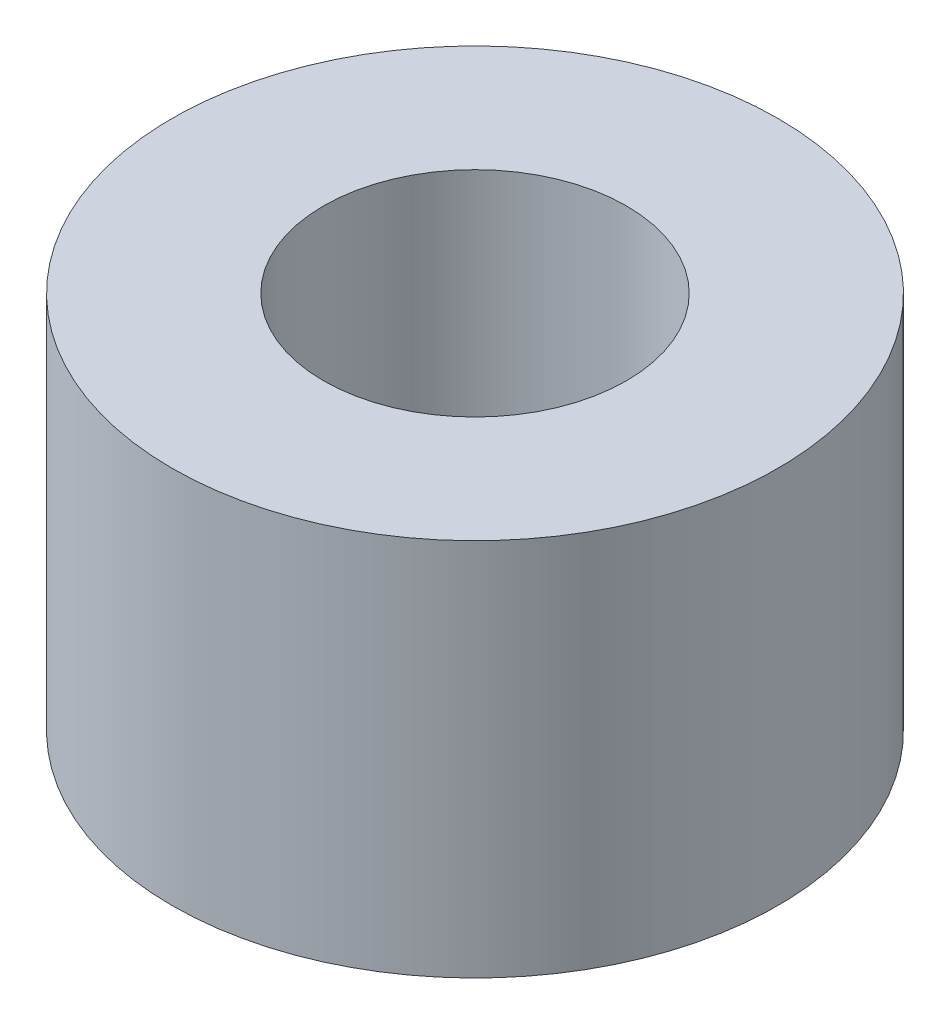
from build123d import *

# Parameters (mm, degrees)
SKETCH1_R           = 2.54
SKETCH1_R_2         = 1.27
BOSS_EXTRUDE1_DEPTH = 3.175


with BuildPart() as part:
    # Sketch1 → Boss-Extrude1 (new body)
    with BuildSketch(Plane(origin=(0, 0, 0), x_dir=(1, 0, 0), z_dir=(0, 1, 0))):
        with Locations(Location((0, 0, 0), (0, 0, 270))):
            Circle(SKETCH1_R)
        with Locations(Location((0, 0, 0), (0, 0, 270))):
            Circle(SKETCH1_R_2, mode=Mode.SUBTRACT)
    extrude(amount=BOSS_EXTRUDE1_DEPTH)


solid = part.part
